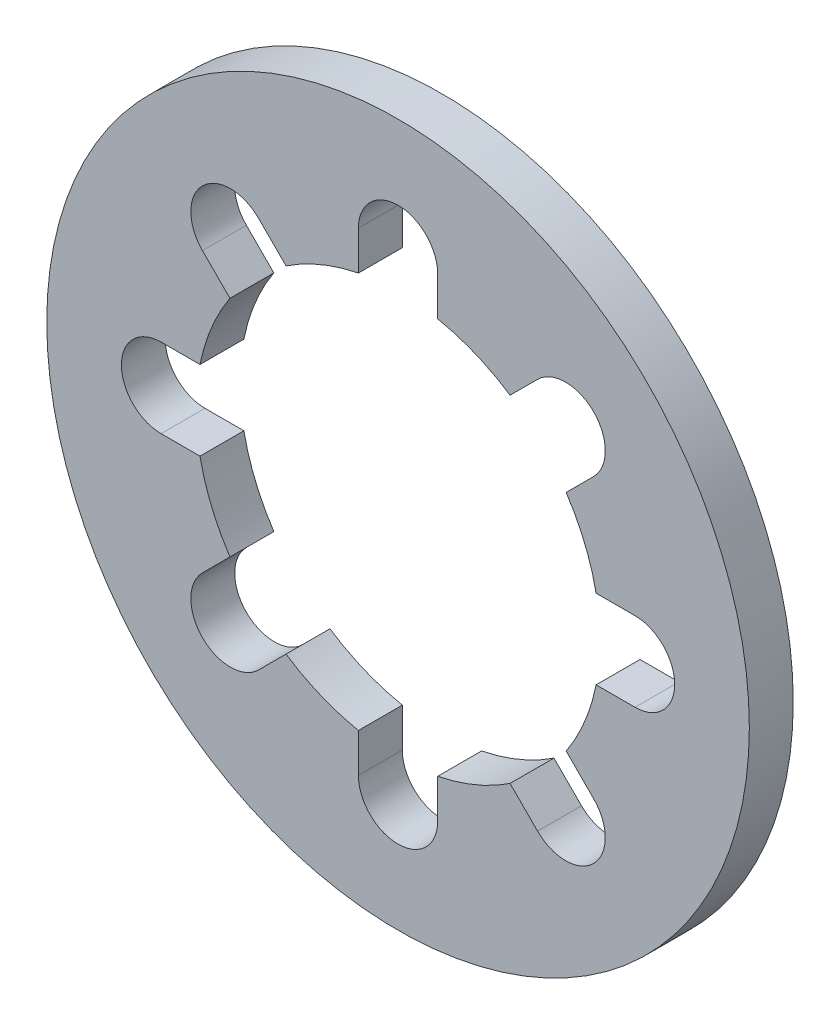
ISO-10303-21;
HEADER;
FILE_DESCRIPTION(('STEP AP214'),'2;1');
FILE_NAME('part.step','',(''),(''),'','','');
FILE_SCHEMA(('AUTOMOTIVE_DESIGN { 1 0 10303 214 1 1 1 1 }'));
ENDSEC;
DATA;
#1=APPLICATION_CONTEXT('core data for automotive mechanical design processes');
#2=APPLICATION_PROTOCOL_DEFINITION('international standard','automotive_design',2000,#1);
#3=PRODUCT_CONTEXT('',#1,'mechanical');
#4=PRODUCT('Part','Part','',(#3));
#5=PRODUCT_RELATED_PRODUCT_CATEGORY('part','',(#4));
#6=PRODUCT_DEFINITION_FORMATION('','',#4);
#7=PRODUCT_DEFINITION_CONTEXT('part definition',#1,'design');
#8=PRODUCT_DEFINITION('design','',#6,#7);
#9=PRODUCT_DEFINITION_SHAPE('','',#8);
#10=(LENGTH_UNIT() NAMED_UNIT(*) SI_UNIT(.MILLI.,.METRE.));
#11=(NAMED_UNIT(*) PLANE_ANGLE_UNIT() SI_UNIT($,.RADIAN.));
#12=(NAMED_UNIT(*) SI_UNIT($,.STERADIAN.) SOLID_ANGLE_UNIT());
#13=UNCERTAINTY_MEASURE_WITH_UNIT(LENGTH_MEASURE(1.E-05),#10,'distance_accuracy_value','');
#14=(GEOMETRIC_REPRESENTATION_CONTEXT(3) GLOBAL_UNCERTAINTY_ASSIGNED_CONTEXT((#13)) GLOBAL_UNIT_ASSIGNED_CONTEXT((#10,
#11,#12)) REPRESENTATION_CONTEXT('',''));
#15=CARTESIAN_POINT('',(0.,0.,0.));
#16=DIRECTION('',(0.,0.,1.));
#17=DIRECTION('',(1.,0.,0.));
#18=AXIS2_PLACEMENT_3D('',#15,#16,#17);
#19=CARTESIAN_POINT('',(0.,0.,-0.5));
#20=DIRECTION('',(0.,0.,1.));
#21=DIRECTION('',(1.,0.,0.));
#22=AXIS2_PLACEMENT_3D('',#19,#20,#21);
#23=CYLINDRICAL_SURFACE('',#22,2.3);
#24=CARTESIAN_POINT('',(0.,0.,-0.5));
#25=DIRECTION('',(0.,0.,1.));
#26=DIRECTION('',(1.,0.,0.));
#27=AXIS2_PLACEMENT_3D('',#24,#25,#26);
#28=CIRCLE('',#27,2.3);
#29=CARTESIAN_POINT('',(1.27535521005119,1.91401909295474,-0.5));
#30=VERTEX_POINT('',#29);
#31=CARTESIAN_POINT('',(0.4516035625,2.25522819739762,-0.5));
#32=VERTEX_POINT('',#31);
#33=EDGE_CURVE('E273',#30,#32,#28,.T.);
#34=ORIENTED_EDGE('',*,*,#33,.F.);
#35=DIRECTION('',(0.,0.,1.));
#36=VECTOR('',#35,1.);
#37=CARTESIAN_POINT('',(1.27535521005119,1.91401909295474,-0.5));
#38=LINE('',#37,#36);
#39=CARTESIAN_POINT('',(1.27535521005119,1.91401909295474,0.));
#40=VERTEX_POINT('',#39);
#41=EDGE_CURVE('E479',#30,#40,#38,.T.);
#42=ORIENTED_EDGE('',*,*,#41,.T.);
#43=CARTESIAN_POINT('',(0.,0.,0.));
#44=DIRECTION('',(0.,0.,1.));
#45=DIRECTION('',(1.,0.,0.));
#46=AXIS2_PLACEMENT_3D('',#43,#44,#45);
#47=CIRCLE('',#46,2.3);
#48=CARTESIAN_POINT('',(0.4516035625,2.25522819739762,0.));
#49=VERTEX_POINT('',#48);
#50=EDGE_CURVE('E289',#40,#49,#47,.T.);
#51=ORIENTED_EDGE('',*,*,#50,.T.);
#52=DIRECTION('',(0.,0.,1.));
#53=VECTOR('',#52,1.);
#54=CARTESIAN_POINT('',(0.4516035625,2.25522819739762,-0.5));
#55=LINE('',#54,#53);
#56=EDGE_CURVE('E284',#32,#49,#55,.T.);
#57=ORIENTED_EDGE('',*,*,#56,.F.);
#58=EDGE_LOOP('',(#34,#42,#51,#57));
#59=FACE_BOUND('',#58,.T.);
#60=ADVANCED_FACE('F39',(#59),#23,.F.);
#61=CARTESIAN_POINT('',(2.25522819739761,0.451603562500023,0.));
#62=VERTEX_POINT('',#61);
#63=CARTESIAN_POINT('',(1.91401909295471,1.27535521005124,0.));
#64=VERTEX_POINT('',#63);
#65=EDGE_CURVE('E264',#62,#64,#47,.T.);
#66=ORIENTED_EDGE('',*,*,#65,.T.);
#67=DIRECTION('',(0.,0.,1.));
#68=VECTOR('',#67,1.);
#69=CARTESIAN_POINT('',(1.91401909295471,1.27535521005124,-0.5));
#70=LINE('',#69,#68);
#71=CARTESIAN_POINT('',(1.91401909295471,1.27535521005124,-0.5));
#72=VERTEX_POINT('',#71);
#73=EDGE_CURVE('E53',#72,#64,#70,.T.);
#74=ORIENTED_EDGE('',*,*,#73,.F.);
#75=CARTESIAN_POINT('',(2.25522819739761,0.451603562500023,-0.5));
#76=VERTEX_POINT('',#75);
#77=EDGE_CURVE('E261',#76,#72,#28,.T.);
#78=ORIENTED_EDGE('',*,*,#77,.F.);
#79=DIRECTION('',(0.,0.,1.));
#80=VECTOR('',#79,1.);
#81=CARTESIAN_POINT('',(2.25522819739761,0.451603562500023,-0.5));
#82=LINE('',#81,#80);
#83=EDGE_CURVE('E456',#76,#62,#82,.T.);
#84=ORIENTED_EDGE('',*,*,#83,.T.);
#85=EDGE_LOOP('',(#66,#74,#78,#84));
#86=FACE_BOUND('',#85,.T.);
#87=ADVANCED_FACE('F263',(#86),#23,.F.);
#88=CARTESIAN_POINT('',(1.91401909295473,-1.2753552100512,0.));
#89=VERTEX_POINT('',#88);
#90=CARTESIAN_POINT('',(2.25522819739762,-0.451603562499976,0.));
#91=VERTEX_POINT('',#90);
#92=EDGE_CURVE('E305',#89,#91,#47,.T.);
#93=ORIENTED_EDGE('',*,*,#92,.T.);
#94=DIRECTION('',(0.,0.,1.));
#95=VECTOR('',#94,1.);
#96=CARTESIAN_POINT('',(2.25522819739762,-0.451603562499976,-0.5));
#97=LINE('',#96,#95);
#98=CARTESIAN_POINT('',(2.25522819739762,-0.451603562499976,-0.5));
#99=VERTEX_POINT('',#98);
#100=EDGE_CURVE('E65',#99,#91,#97,.T.);
#101=ORIENTED_EDGE('',*,*,#100,.F.);
#102=CARTESIAN_POINT('',(1.91401909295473,-1.2753552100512,-0.5));
#103=VERTEX_POINT('',#102);
#104=EDGE_CURVE('E274',#103,#99,#28,.T.);
#105=ORIENTED_EDGE('',*,*,#104,.F.);
#106=DIRECTION('',(0.,0.,1.));
#107=VECTOR('',#106,1.);
#108=CARTESIAN_POINT('',(1.91401909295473,-1.2753552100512,-0.5));
#109=LINE('',#108,#107);
#110=EDGE_CURVE('E435',#103,#89,#109,.T.);
#111=ORIENTED_EDGE('',*,*,#110,.T.);
#112=EDGE_LOOP('',(#93,#101,#105,#111));
#113=FACE_BOUND('',#112,.T.);
#114=ADVANCED_FACE('F529',(#113),#23,.F.);
#115=CARTESIAN_POINT('',(0.451603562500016,-2.25522819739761,0.));
#116=VERTEX_POINT('',#115);
#117=CARTESIAN_POINT('',(1.27535521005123,-1.91401909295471,0.));
#118=VERTEX_POINT('',#117);
#119=EDGE_CURVE('E852',#116,#118,#47,.T.);
#120=ORIENTED_EDGE('',*,*,#119,.T.);
#121=DIRECTION('',(0.,0.,1.));
#122=VECTOR('',#121,1.);
#123=CARTESIAN_POINT('',(1.27535521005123,-1.91401909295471,-0.5));
#124=LINE('',#123,#122);
#125=CARTESIAN_POINT('',(1.27535521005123,-1.91401909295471,-0.5));
#126=VERTEX_POINT('',#125);
#127=EDGE_CURVE('E439',#126,#118,#124,.T.);
#128=ORIENTED_EDGE('',*,*,#127,.F.);
#129=CARTESIAN_POINT('',(0.451603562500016,-2.25522819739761,-0.5));
#130=VERTEX_POINT('',#129);
#131=EDGE_CURVE('E277',#130,#126,#28,.T.);
#132=ORIENTED_EDGE('',*,*,#131,.F.);
#133=DIRECTION('',(0.,0.,1.));
#134=VECTOR('',#133,1.);
#135=CARTESIAN_POINT('',(0.451603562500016,-2.25522819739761,-0.5));
#136=LINE('',#135,#134);
#137=EDGE_CURVE('E406',#130,#116,#136,.T.);
#138=ORIENTED_EDGE('',*,*,#137,.T.);
#139=EDGE_LOOP('',(#120,#128,#132,#138));
#140=FACE_BOUND('',#139,.T.);
#141=ADVANCED_FACE('F763',(#140),#23,.F.);
#142=CARTESIAN_POINT('',(-1.27535521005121,-1.91401909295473,0.));
#143=VERTEX_POINT('',#142);
#144=CARTESIAN_POINT('',(-0.451603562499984,-2.25522819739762,0.));
#145=VERTEX_POINT('',#144);
#146=EDGE_CURVE('E864',#143,#145,#47,.T.);
#147=ORIENTED_EDGE('',*,*,#146,.T.);
#148=DIRECTION('',(0.,0.,1.));
#149=VECTOR('',#148,1.);
#150=CARTESIAN_POINT('',(-0.451603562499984,-2.25522819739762,-0.5));
#151=LINE('',#150,#149);
#152=CARTESIAN_POINT('',(-0.451603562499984,-2.25522819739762,-0.5));
#153=VERTEX_POINT('',#152);
#154=EDGE_CURVE('E412',#153,#145,#151,.T.);
#155=ORIENTED_EDGE('',*,*,#154,.F.);
#156=CARTESIAN_POINT('',(-1.27535521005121,-1.91401909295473,-0.5));
#157=VERTEX_POINT('',#156);
#158=EDGE_CURVE('E844',#157,#153,#28,.T.);
#159=ORIENTED_EDGE('',*,*,#158,.F.);
#160=DIRECTION('',(0.,0.,1.));
#161=VECTOR('',#160,1.);
#162=CARTESIAN_POINT('',(-1.27535521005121,-1.91401909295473,-0.5));
#163=LINE('',#162,#161);
#164=EDGE_CURVE('E379',#157,#143,#163,.T.);
#165=ORIENTED_EDGE('',*,*,#164,.T.);
#166=EDGE_LOOP('',(#147,#155,#159,#165));
#167=FACE_BOUND('',#166,.T.);
#168=ADVANCED_FACE('F775',(#167),#23,.F.);
#169=CARTESIAN_POINT('',(-2.25522819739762,-0.451603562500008,0.));
#170=VERTEX_POINT('',#169);
#171=CARTESIAN_POINT('',(-1.91401909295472,-1.27535521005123,0.));
#172=VERTEX_POINT('',#171);
#173=EDGE_CURVE('E294',#170,#172,#47,.T.);
#174=ORIENTED_EDGE('',*,*,#173,.T.);
#175=DIRECTION('',(0.,0.,1.));
#176=VECTOR('',#175,1.);
#177=CARTESIAN_POINT('',(-1.91401909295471,-1.27535521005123,-0.5));
#178=LINE('',#177,#176);
#179=CARTESIAN_POINT('',(-1.91401909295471,-1.27535521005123,-0.5));
#180=VERTEX_POINT('',#179);
#181=EDGE_CURVE('E387',#180,#172,#178,.T.);
#182=ORIENTED_EDGE('',*,*,#181,.F.);
#183=CARTESIAN_POINT('',(-2.25522819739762,-0.451603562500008,-0.5));
#184=VERTEX_POINT('',#183);
#185=EDGE_CURVE('E842',#184,#180,#28,.T.);
#186=ORIENTED_EDGE('',*,*,#185,.F.);
#187=DIRECTION('',(0.,0.,1.));
#188=VECTOR('',#187,1.);
#189=CARTESIAN_POINT('',(-2.25522819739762,-0.451603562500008,-0.5));
#190=LINE('',#189,#188);
#191=EDGE_CURVE('E354',#184,#170,#190,.T.);
#192=ORIENTED_EDGE('',*,*,#191,.T.);
#193=EDGE_LOOP('',(#174,#182,#186,#192));
#194=FACE_BOUND('',#193,.T.);
#195=ADVANCED_FACE('F779',(#194),#23,.F.);
#196=CARTESIAN_POINT('',(-1.91401909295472,1.27535521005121,0.));
#197=VERTEX_POINT('',#196);
#198=CARTESIAN_POINT('',(-2.25522819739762,0.451603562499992,0.));
#199=VERTEX_POINT('',#198);
#200=EDGE_CURVE('E286',#197,#199,#47,.T.);
#201=ORIENTED_EDGE('',*,*,#200,.T.);
#202=DIRECTION('',(0.,0.,1.));
#203=VECTOR('',#202,1.);
#204=CARTESIAN_POINT('',(-2.25522819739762,0.451603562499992,-0.5));
#205=LINE('',#204,#203);
#206=CARTESIAN_POINT('',(-2.25522819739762,0.451603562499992,-0.5));
#207=VERTEX_POINT('',#206);
#208=EDGE_CURVE('E365',#207,#199,#205,.T.);
#209=ORIENTED_EDGE('',*,*,#208,.F.);
#210=CARTESIAN_POINT('',(-1.91401909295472,1.27535521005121,-0.5));
#211=VERTEX_POINT('',#210);
#212=EDGE_CURVE('E282',#211,#207,#28,.T.);
#213=ORIENTED_EDGE('',*,*,#212,.F.);
#214=DIRECTION('',(0.,0.,1.));
#215=VECTOR('',#214,1.);
#216=CARTESIAN_POINT('',(-1.91401909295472,1.27535521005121,-0.5));
#217=LINE('',#216,#215);
#218=EDGE_CURVE('E329',#211,#197,#217,.T.);
#219=ORIENTED_EDGE('',*,*,#218,.T.);
#220=EDGE_LOOP('',(#201,#209,#213,#219));
#221=FACE_BOUND('',#220,.T.);
#222=ADVANCED_FACE('F525',(#221),#23,.F.);
#223=CARTESIAN_POINT('',(0.,0.,-0.5));
#224=DIRECTION('',(0.,0.,1.));
#225=DIRECTION('',(1.,0.,0.));
#226=AXIS2_PLACEMENT_3D('',#223,#224,#225);
#227=CYLINDRICAL_SURFACE('',#226,4.);
#228=CARTESIAN_POINT('',(0.,0.,-0.5));
#229=DIRECTION('',(0.,0.,1.));
#230=DIRECTION('',(1.,0.,0.));
#231=AXIS2_PLACEMENT_3D('',#228,#229,#230);
#232=CIRCLE('',#231,4.);
#233=CARTESIAN_POINT('',(4.,0.,-0.5));
#234=VERTEX_POINT('',#233);
#235=EDGE_CURVE('E11',#234,#234,#232,.T.);
#236=ORIENTED_EDGE('',*,*,#235,.T.);
#237=EDGE_LOOP('',(#236));
#238=FACE_BOUND('',#237,.T.);
#239=CARTESIAN_POINT('',(0.,0.,0.));
#240=DIRECTION('',(0.,0.,1.));
#241=DIRECTION('',(1.,0.,0.));
#242=AXIS2_PLACEMENT_3D('',#239,#240,#241);
#243=CIRCLE('',#242,4.);
#244=CARTESIAN_POINT('',(4.,0.,0.));
#245=VERTEX_POINT('',#244);
#246=EDGE_CURVE('E43',#245,#245,#243,.T.);
#247=ORIENTED_EDGE('',*,*,#246,.F.);
#248=EDGE_LOOP('',(#247));
#249=FACE_BOUND('',#248,.T.);
#250=ADVANCED_FACE('F41',(#238,#249),#227,.T.);
#251=CARTESIAN_POINT('',(0.,0.,-0.5));
#252=DIRECTION('',(0.,0.,1.));
#253=DIRECTION('',(1.,0.,0.));
#254=AXIS2_PLACEMENT_3D('',#251,#252,#253);
#255=PLANE('',#254);
#256=CARTESIAN_POINT('',(1.90805441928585,1.9080544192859,-0.5));
#257=DIRECTION('',(0.,0.,1.));
#258=DIRECTION('',(-0.707106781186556,0.707106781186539,0.));
#259=AXIS2_PLACEMENT_3D('',#256,#257,#258);
#260=CIRCLE('',#259,0.4516035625);
#261=CARTESIAN_POINT('',(2.22738636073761,1.58872247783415,-0.5));
#262=VERTEX_POINT('',#261);
#263=CARTESIAN_POINT('',(1.58872247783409,2.22738636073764,-0.5));
#264=VERTEX_POINT('',#263);
#265=EDGE_CURVE('E253',#262,#264,#260,.T.);
#266=ORIENTED_EDGE('',*,*,#265,.T.);
#267=DIRECTION('',(-0.707106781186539,-0.707106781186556,0.));
#268=VECTOR('',#267,1.);
#269=CARTESIAN_POINT('',(1.27535521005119,1.91401909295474,-0.5));
#270=LINE('',#269,#268);
#271=EDGE_CURVE('E268',#264,#30,#270,.T.);
#272=ORIENTED_EDGE('',*,*,#271,.T.);
#273=ORIENTED_EDGE('',*,*,#33,.T.);
#274=DIRECTION('',(0.,1.,0.));
#275=VECTOR('',#274,1.);
#276=CARTESIAN_POINT('',(0.4516035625,2.6983964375,-0.5));
#277=LINE('',#276,#275);
#278=CARTESIAN_POINT('',(0.4516035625,2.6983964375,-0.5));
#279=VERTEX_POINT('',#278);
#280=EDGE_CURVE('E323',#32,#279,#277,.T.);
#281=ORIENTED_EDGE('',*,*,#280,.T.);
#282=CARTESIAN_POINT('',(0.,2.6983964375,-0.5));
#283=DIRECTION('',(0.,0.,1.));
#284=DIRECTION('',(-1.,0.,0.));
#285=AXIS2_PLACEMENT_3D('',#282,#283,#284);
#286=CIRCLE('',#285,0.4516035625);
#287=CARTESIAN_POINT('',(-0.4516035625,2.6983964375,-0.5));
#288=VERTEX_POINT('',#287);
#289=EDGE_CURVE('E318',#279,#288,#286,.T.);
#290=ORIENTED_EDGE('',*,*,#289,.T.);
#291=DIRECTION('',(0.,-1.,0.));
#292=VECTOR('',#291,1.);
#293=CARTESIAN_POINT('',(-0.4516035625,2.25522819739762,-0.5));
#294=LINE('',#293,#292);
#295=CARTESIAN_POINT('',(-0.4516035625,2.25522819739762,-0.5));
#296=VERTEX_POINT('',#295);
#297=EDGE_CURVE('E314',#288,#296,#294,.T.);
#298=ORIENTED_EDGE('',*,*,#297,.T.);
#299=CARTESIAN_POINT('',(-1.27535521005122,1.91401909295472,-0.5));
#300=VERTEX_POINT('',#299);
#301=EDGE_CURVE('E279',#296,#300,#28,.T.);
#302=ORIENTED_EDGE('',*,*,#301,.T.);
#303=DIRECTION('',(-0.707106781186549,0.707106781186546,0.));
#304=VECTOR('',#303,1.);
#305=CARTESIAN_POINT('',(-1.58872247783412,2.22738636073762,-0.5));
#306=LINE('',#305,#304);
#307=CARTESIAN_POINT('',(-1.58872247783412,2.22738636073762,-0.5));
#308=VERTEX_POINT('',#307);
#309=EDGE_CURVE('E350',#300,#308,#306,.T.);
#310=ORIENTED_EDGE('',*,*,#309,.T.);
#311=CARTESIAN_POINT('',(-1.90805441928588,1.90805441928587,-0.5));
#312=DIRECTION('',(0.,0.,1.));
#313=DIRECTION('',(-0.707106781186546,-0.707106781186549,0.));
#314=AXIS2_PLACEMENT_3D('',#311,#312,#313);
#315=CIRCLE('',#314,0.4516035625);
#316=CARTESIAN_POINT('',(-2.22738636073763,1.58872247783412,-0.5));
#317=VERTEX_POINT('',#316);
#318=EDGE_CURVE('E357',#308,#317,#315,.T.);
#319=ORIENTED_EDGE('',*,*,#318,.T.);
#320=DIRECTION('',(0.707106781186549,-0.707106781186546,0.));
#321=VECTOR('',#320,1.);
#322=CARTESIAN_POINT('',(-1.91401909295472,1.27535521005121,-0.5));
#323=LINE('',#322,#321);
#324=EDGE_CURVE('E339',#317,#211,#323,.T.);
#325=ORIENTED_EDGE('',*,*,#324,.T.);
#326=ORIENTED_EDGE('',*,*,#212,.T.);
#327=DIRECTION('',(-1.,0.,0.));
#328=VECTOR('',#327,1.);
#329=CARTESIAN_POINT('',(-2.6983964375,0.45160356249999,-0.5));
#330=LINE('',#329,#328);
#331=CARTESIAN_POINT('',(-2.6983964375,0.45160356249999,-0.5));
#332=VERTEX_POINT('',#331);
#333=EDGE_CURVE('E373',#207,#332,#330,.T.);
#334=ORIENTED_EDGE('',*,*,#333,.T.);
#335=CARTESIAN_POINT('',(-2.6983964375,0.,-0.5));
#336=DIRECTION('',(0.,0.,1.));
#337=DIRECTION('',(0.,-1.,0.));
#338=AXIS2_PLACEMENT_3D('',#335,#336,#337);
#339=CIRCLE('',#338,0.4516035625);
#340=CARTESIAN_POINT('',(-2.6983964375,-0.451603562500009,-0.5));
#341=VERTEX_POINT('',#340);
#342=EDGE_CURVE('E384',#332,#341,#339,.T.);
#343=ORIENTED_EDGE('',*,*,#342,.T.);
#344=DIRECTION('',(1.,0.,0.));
#345=VECTOR('',#344,1.);
#346=CARTESIAN_POINT('',(-2.25522819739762,-0.451603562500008,-0.5));
#347=LINE('',#346,#345);
#348=EDGE_CURVE('E362',#341,#184,#347,.T.);
#349=ORIENTED_EDGE('',*,*,#348,.T.);
#350=ORIENTED_EDGE('',*,*,#185,.T.);
#351=DIRECTION('',(-0.707106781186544,-0.707106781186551,0.));
#352=VECTOR('',#351,1.);
#353=CARTESIAN_POINT('',(-2.22738636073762,-1.58872247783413,-0.5));
#354=LINE('',#353,#352);
#355=CARTESIAN_POINT('',(-2.22738636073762,-1.58872247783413,-0.5));
#356=VERTEX_POINT('',#355);
#357=EDGE_CURVE('E399',#180,#356,#354,.T.);
#358=ORIENTED_EDGE('',*,*,#357,.T.);
#359=CARTESIAN_POINT('',(-1.90805441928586,-1.90805441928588,-0.5));
#360=DIRECTION('',(0.,0.,1.));
#361=DIRECTION('',(0.707106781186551,-0.707106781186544,0.));
#362=AXIS2_PLACEMENT_3D('',#359,#360,#361);
#363=CIRCLE('',#362,0.4516035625);
#364=CARTESIAN_POINT('',(-1.58872247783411,-2.22738636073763,-0.5));
#365=VERTEX_POINT('',#364);
#366=EDGE_CURVE('E408',#356,#365,#363,.T.);
#367=ORIENTED_EDGE('',*,*,#366,.T.);
#368=DIRECTION('',(0.707106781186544,0.707106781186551,0.));
#369=VECTOR('',#368,1.);
#370=CARTESIAN_POINT('',(-1.27535521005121,-1.91401909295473,-0.5));
#371=LINE('',#370,#369);
#372=EDGE_CURVE('E393',#365,#157,#371,.T.);
#373=ORIENTED_EDGE('',*,*,#372,.T.);
#374=ORIENTED_EDGE('',*,*,#158,.T.);
#375=DIRECTION('',(0.,-1.,0.));
#376=VECTOR('',#375,1.);
#377=CARTESIAN_POINT('',(-0.451603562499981,-2.6983964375,-0.5));
#378=LINE('',#377,#376);
#379=CARTESIAN_POINT('',(-0.451603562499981,-2.6983964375,-0.5));
#380=VERTEX_POINT('',#379);
#381=EDGE_CURVE('E424',#153,#380,#378,.T.);
#382=ORIENTED_EDGE('',*,*,#381,.T.);
#383=CARTESIAN_POINT('',(0.,-2.6983964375,-0.5));
#384=DIRECTION('',(0.,0.,1.));
#385=DIRECTION('',(1.,0.,0.));
#386=AXIS2_PLACEMENT_3D('',#383,#384,#385);
#387=CIRCLE('',#386,0.4516035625);
#388=CARTESIAN_POINT('',(0.451603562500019,-2.6983964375,-0.5));
#389=VERTEX_POINT('',#388);
#390=EDGE_CURVE('E434',#380,#389,#387,.T.);
#391=ORIENTED_EDGE('',*,*,#390,.T.);
#392=DIRECTION('',(0.,1.,0.));
#393=VECTOR('',#392,1.);
#394=CARTESIAN_POINT('',(0.451603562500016,-2.25522819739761,-0.5));
#395=LINE('',#394,#393);
#396=EDGE_CURVE('E420',#389,#130,#395,.T.);
#397=ORIENTED_EDGE('',*,*,#396,.T.);
#398=ORIENTED_EDGE('',*,*,#131,.T.);
#399=DIRECTION('',(0.707106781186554,-0.707106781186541,0.));
#400=VECTOR('',#399,1.);
#401=CARTESIAN_POINT('',(1.58872247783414,-2.22738636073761,-0.5));
#402=LINE('',#401,#400);
#403=CARTESIAN_POINT('',(1.58872247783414,-2.22738636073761,-0.5));
#404=VERTEX_POINT('',#403);
#405=EDGE_CURVE('E451',#126,#404,#402,.T.);
#406=ORIENTED_EDGE('',*,*,#405,.T.);
#407=CARTESIAN_POINT('',(1.90805441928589,-1.90805441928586,-0.5));
#408=DIRECTION('',(0.,0.,1.));
#409=DIRECTION('',(0.707106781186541,0.707106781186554,0.));
#410=AXIS2_PLACEMENT_3D('',#407,#408,#409);
#411=CIRCLE('',#410,0.4516035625);
#412=CARTESIAN_POINT('',(2.22738636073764,-1.5887224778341,-0.5));
#413=VERTEX_POINT('',#412);
#414=EDGE_CURVE('E463',#404,#413,#411,.T.);
#415=ORIENTED_EDGE('',*,*,#414,.T.);
#416=DIRECTION('',(-0.707106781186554,0.707106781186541,0.));
#417=VECTOR('',#416,1.);
#418=CARTESIAN_POINT('',(1.91401909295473,-1.2753552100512,-0.5));
#419=LINE('',#418,#417);
#420=EDGE_CURVE('E442',#413,#103,#419,.T.);
#421=ORIENTED_EDGE('',*,*,#420,.T.);
#422=ORIENTED_EDGE('',*,*,#104,.T.);
#423=DIRECTION('',(1.,0.,0.));
#424=VECTOR('',#423,1.);
#425=CARTESIAN_POINT('',(2.6983964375,-0.451603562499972,-0.5));
#426=LINE('',#425,#424);
#427=CARTESIAN_POINT('',(2.6983964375,-0.451603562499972,-0.5));
#428=VERTEX_POINT('',#427);
#429=EDGE_CURVE('E473',#99,#428,#426,.T.);
#430=ORIENTED_EDGE('',*,*,#429,.T.);
#431=CARTESIAN_POINT('',(2.6983964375,0.,-0.5));
#432=DIRECTION('',(0.,0.,1.));
#433=DIRECTION('',(0.,1.,0.));
#434=AXIS2_PLACEMENT_3D('',#431,#432,#433);
#435=CIRCLE('',#434,0.4516035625);
#436=CARTESIAN_POINT('',(2.6983964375,0.451603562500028,-0.5));
#437=VERTEX_POINT('',#436);
#438=EDGE_CURVE('E485',#428,#437,#435,.T.);
#439=ORIENTED_EDGE('',*,*,#438,.T.);
#440=DIRECTION('',(-1.,0.,0.));
#441=VECTOR('',#440,1.);
#442=CARTESIAN_POINT('',(2.25522819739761,0.451603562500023,-0.5));
#443=LINE('',#442,#441);
#444=EDGE_CURVE('E271',#437,#76,#443,.T.);
#445=ORIENTED_EDGE('',*,*,#444,.T.);
#446=ORIENTED_EDGE('',*,*,#77,.T.);
#447=DIRECTION('',(0.707106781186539,0.707106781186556,0.));
#448=VECTOR('',#447,1.);
#449=CARTESIAN_POINT('',(2.22738636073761,1.58872247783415,-0.5));
#450=LINE('',#449,#448);
#451=EDGE_CURVE('E247',#72,#262,#450,.T.);
#452=ORIENTED_EDGE('',*,*,#451,.T.);
#453=EDGE_LOOP('',(#266,#272,#273,#281,#290,#298,#302,#310,#319,#325,#326,#334,#343,#349,#350,
#358,#367,#373,#374,#382,#391,#397,#398,#406,#415,#421,#422,#430,#439,#445,#446,#452));
#454=FACE_BOUND('',#453,.T.);
#455=ORIENTED_EDGE('',*,*,#235,.F.);
#456=EDGE_LOOP('',(#455));
#457=FACE_BOUND('',#456,.T.);
#458=ADVANCED_FACE('F269',(#454,#457),#255,.F.);
#459=CARTESIAN_POINT('',(0.,0.,0.));
#460=DIRECTION('',(0.,0.,1.));
#461=DIRECTION('',(1.,0.,0.));
#462=AXIS2_PLACEMENT_3D('',#459,#460,#461);
#463=PLANE('',#462);
#464=DIRECTION('',(-0.707106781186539,-0.707106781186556,0.));
#465=VECTOR('',#464,1.);
#466=CARTESIAN_POINT('',(1.27535521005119,1.91401909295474,0.));
#467=LINE('',#466,#465);
#468=CARTESIAN_POINT('',(1.58872247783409,2.22738636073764,0.));
#469=VERTEX_POINT('',#468);
#470=EDGE_CURVE('E256',#469,#40,#467,.T.);
#471=ORIENTED_EDGE('',*,*,#470,.F.);
#472=CARTESIAN_POINT('',(1.90805441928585,1.9080544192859,0.));
#473=DIRECTION('',(0.,0.,1.));
#474=DIRECTION('',(-0.707106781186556,0.707106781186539,0.));
#475=AXIS2_PLACEMENT_3D('',#472,#473,#474);
#476=CIRCLE('',#475,0.4516035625);
#477=CARTESIAN_POINT('',(2.22738636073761,1.58872247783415,0.));
#478=VERTEX_POINT('',#477);
#479=EDGE_CURVE('E493',#478,#469,#476,.T.);
#480=ORIENTED_EDGE('',*,*,#479,.F.);
#481=DIRECTION('',(0.707106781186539,0.707106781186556,0.));
#482=VECTOR('',#481,1.);
#483=CARTESIAN_POINT('',(2.22738636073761,1.58872247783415,0.));
#484=LINE('',#483,#482);
#485=EDGE_CURVE('E494',#64,#478,#484,.T.);
#486=ORIENTED_EDGE('',*,*,#485,.F.);
#487=ORIENTED_EDGE('',*,*,#65,.F.);
#488=DIRECTION('',(-1.,0.,0.));
#489=VECTOR('',#488,1.);
#490=CARTESIAN_POINT('',(2.25522819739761,0.451603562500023,0.));
#491=LINE('',#490,#489);
#492=CARTESIAN_POINT('',(2.6983964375,0.451603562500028,0.));
#493=VERTEX_POINT('',#492);
#494=EDGE_CURVE('E475',#493,#62,#491,.T.);
#495=ORIENTED_EDGE('',*,*,#494,.F.);
#496=CARTESIAN_POINT('',(2.6983964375,0.,0.));
#497=DIRECTION('',(0.,0.,1.));
#498=DIRECTION('',(0.,1.,0.));
#499=AXIS2_PLACEMENT_3D('',#496,#497,#498);
#500=CIRCLE('',#499,0.4516035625);
#501=CARTESIAN_POINT('',(2.6983964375,-0.451603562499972,0.));
#502=VERTEX_POINT('',#501);
#503=EDGE_CURVE('E474',#502,#493,#500,.T.);
#504=ORIENTED_EDGE('',*,*,#503,.F.);
#505=DIRECTION('',(1.,0.,0.));
#506=VECTOR('',#505,1.);
#507=CARTESIAN_POINT('',(2.6983964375,-0.451603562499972,0.));
#508=LINE('',#507,#506);
#509=EDGE_CURVE('E476',#91,#502,#508,.T.);
#510=ORIENTED_EDGE('',*,*,#509,.F.);
#511=ORIENTED_EDGE('',*,*,#92,.F.);
#512=DIRECTION('',(-0.707106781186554,0.707106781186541,0.));
#513=VECTOR('',#512,1.);
#514=CARTESIAN_POINT('',(1.91401909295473,-1.2753552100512,0.));
#515=LINE('',#514,#513);
#516=CARTESIAN_POINT('',(2.22738636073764,-1.5887224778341,0.));
#517=VERTEX_POINT('',#516);
#518=EDGE_CURVE('E446',#517,#89,#515,.T.);
#519=ORIENTED_EDGE('',*,*,#518,.F.);
#520=CARTESIAN_POINT('',(1.90805441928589,-1.90805441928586,0.));
#521=DIRECTION('',(0.,0.,1.));
#522=DIRECTION('',(0.707106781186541,0.707106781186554,0.));
#523=AXIS2_PLACEMENT_3D('',#520,#521,#522);
#524=CIRCLE('',#523,0.4516035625);
#525=CARTESIAN_POINT('',(1.58872247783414,-2.22738636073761,0.));
#526=VERTEX_POINT('',#525);
#527=EDGE_CURVE('E455',#526,#517,#524,.T.);
#528=ORIENTED_EDGE('',*,*,#527,.F.);
#529=DIRECTION('',(0.707106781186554,-0.707106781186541,0.));
#530=VECTOR('',#529,1.);
#531=CARTESIAN_POINT('',(1.58872247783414,-2.22738636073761,0.));
#532=LINE('',#531,#530);
#533=EDGE_CURVE('E454',#118,#526,#532,.T.);
#534=ORIENTED_EDGE('',*,*,#533,.F.);
#535=ORIENTED_EDGE('',*,*,#119,.F.);
#536=DIRECTION('',(0.,1.,0.));
#537=VECTOR('',#536,1.);
#538=CARTESIAN_POINT('',(0.451603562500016,-2.25522819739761,0.));
#539=LINE('',#538,#537);
#540=CARTESIAN_POINT('',(0.451603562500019,-2.6983964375,0.));
#541=VERTEX_POINT('',#540);
#542=EDGE_CURVE('E421',#541,#116,#539,.T.);
#543=ORIENTED_EDGE('',*,*,#542,.F.);
#544=CARTESIAN_POINT('',(0.,-2.6983964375,0.));
#545=DIRECTION('',(0.,0.,1.));
#546=DIRECTION('',(1.,0.,0.));
#547=AXIS2_PLACEMENT_3D('',#544,#545,#546);
#548=CIRCLE('',#547,0.4516035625);
#549=CARTESIAN_POINT('',(-0.451603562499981,-2.6983964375,0.));
#550=VERTEX_POINT('',#549);
#551=EDGE_CURVE('E428',#550,#541,#548,.T.);
#552=ORIENTED_EDGE('',*,*,#551,.F.);
#553=DIRECTION('',(0.,-1.,0.));
#554=VECTOR('',#553,1.);
#555=CARTESIAN_POINT('',(-0.451603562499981,-2.6983964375,0.));
#556=LINE('',#555,#554);
#557=EDGE_CURVE('E429',#145,#550,#556,.T.);
#558=ORIENTED_EDGE('',*,*,#557,.F.);
#559=ORIENTED_EDGE('',*,*,#146,.F.);
#560=DIRECTION('',(0.707106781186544,0.707106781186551,0.));
#561=VECTOR('',#560,1.);
#562=CARTESIAN_POINT('',(-1.27535521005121,-1.91401909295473,0.));
#563=LINE('',#562,#561);
#564=CARTESIAN_POINT('',(-1.58872247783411,-2.22738636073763,0.));
#565=VERTEX_POINT('',#564);
#566=EDGE_CURVE('E400',#565,#143,#563,.T.);
#567=ORIENTED_EDGE('',*,*,#566,.F.);
#568=CARTESIAN_POINT('',(-1.90805441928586,-1.90805441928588,0.));
#569=DIRECTION('',(0.,0.,1.));
#570=DIRECTION('',(0.707106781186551,-0.707106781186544,0.));
#571=AXIS2_PLACEMENT_3D('',#568,#569,#570);
#572=CIRCLE('',#571,0.4516035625);
#573=CARTESIAN_POINT('',(-2.22738636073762,-1.58872247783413,0.));
#574=VERTEX_POINT('',#573);
#575=EDGE_CURVE('E397',#574,#565,#572,.T.);
#576=ORIENTED_EDGE('',*,*,#575,.F.);
#577=DIRECTION('',(-0.707106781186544,-0.707106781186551,0.));
#578=VECTOR('',#577,1.);
#579=CARTESIAN_POINT('',(-2.22738636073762,-1.58872247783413,0.));
#580=LINE('',#579,#578);
#581=EDGE_CURVE('E401',#172,#574,#580,.T.);
#582=ORIENTED_EDGE('',*,*,#581,.F.);
#583=ORIENTED_EDGE('',*,*,#173,.F.);
#584=DIRECTION('',(1.,0.,0.));
#585=VECTOR('',#584,1.);
#586=CARTESIAN_POINT('',(-2.25522819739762,-0.451603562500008,0.));
#587=LINE('',#586,#585);
#588=CARTESIAN_POINT('',(-2.6983964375,-0.451603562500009,0.));
#589=VERTEX_POINT('',#588);
#590=EDGE_CURVE('E371',#589,#170,#587,.T.);
#591=ORIENTED_EDGE('',*,*,#590,.F.);
#592=CARTESIAN_POINT('',(-2.6983964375,0.,0.));
#593=DIRECTION('',(0.,0.,1.));
#594=DIRECTION('',(0.,-1.,0.));
#595=AXIS2_PLACEMENT_3D('',#592,#593,#594);
#596=CIRCLE('',#595,0.4516035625);
#597=CARTESIAN_POINT('',(-2.6983964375,0.45160356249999,0.));
#598=VERTEX_POINT('',#597);
#599=EDGE_CURVE('E372',#598,#589,#596,.T.);
#600=ORIENTED_EDGE('',*,*,#599,.F.);
#601=DIRECTION('',(-1.,0.,0.));
#602=VECTOR('',#601,1.);
#603=CARTESIAN_POINT('',(-2.6983964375,0.45160356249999,0.));
#604=LINE('',#603,#602);
#605=EDGE_CURVE('E380',#199,#598,#604,.T.);
#606=ORIENTED_EDGE('',*,*,#605,.F.);
#607=ORIENTED_EDGE('',*,*,#200,.F.);
#608=DIRECTION('',(0.707106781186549,-0.707106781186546,0.));
#609=VECTOR('',#608,1.);
#610=CARTESIAN_POINT('',(-1.91401909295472,1.27535521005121,0.));
#611=LINE('',#610,#609);
#612=CARTESIAN_POINT('',(-2.22738636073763,1.58872247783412,0.));
#613=VERTEX_POINT('',#612);
#614=EDGE_CURVE('E344',#613,#197,#611,.T.);
#615=ORIENTED_EDGE('',*,*,#614,.F.);
#616=CARTESIAN_POINT('',(-1.90805441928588,1.90805441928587,0.));
#617=DIRECTION('',(0.,0.,1.));
#618=DIRECTION('',(-0.707106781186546,-0.707106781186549,0.));
#619=AXIS2_PLACEMENT_3D('',#616,#617,#618);
#620=CIRCLE('',#619,0.4516035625);
#621=CARTESIAN_POINT('',(-1.58872247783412,2.22738636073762,0.));
#622=VERTEX_POINT('',#621);
#623=EDGE_CURVE('E346',#622,#613,#620,.T.);
#624=ORIENTED_EDGE('',*,*,#623,.F.);
#625=DIRECTION('',(-0.707106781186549,0.707106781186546,0.));
#626=VECTOR('',#625,1.);
#627=CARTESIAN_POINT('',(-1.58872247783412,2.22738636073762,0.));
#628=LINE('',#627,#626);
#629=CARTESIAN_POINT('',(-1.27535521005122,1.91401909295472,0.));
#630=VERTEX_POINT('',#629);
#631=EDGE_CURVE('E353',#630,#622,#628,.T.);
#632=ORIENTED_EDGE('',*,*,#631,.F.);
#633=CARTESIAN_POINT('',(-0.4516035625,2.25522819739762,0.));
#634=VERTEX_POINT('',#633);
#635=EDGE_CURVE('E278',#634,#630,#47,.T.);
#636=ORIENTED_EDGE('',*,*,#635,.F.);
#637=DIRECTION('',(0.,-1.,0.));
#638=VECTOR('',#637,1.);
#639=CARTESIAN_POINT('',(-0.4516035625,2.25522819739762,0.));
#640=LINE('',#639,#638);
#641=CARTESIAN_POINT('',(-0.4516035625,2.6983964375,0.));
#642=VERTEX_POINT('',#641);
#643=EDGE_CURVE('E307',#642,#634,#640,.T.);
#644=ORIENTED_EDGE('',*,*,#643,.F.);
#645=CARTESIAN_POINT('',(0.,2.6983964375,0.));
#646=DIRECTION('',(0.,0.,1.));
#647=DIRECTION('',(-1.,0.,0.));
#648=AXIS2_PLACEMENT_3D('',#645,#646,#647);
#649=CIRCLE('',#648,0.4516035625);
#650=CARTESIAN_POINT('',(0.4516035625,2.6983964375,0.));
#651=VERTEX_POINT('',#650);
#652=EDGE_CURVE('E327',#651,#642,#649,.T.);
#653=ORIENTED_EDGE('',*,*,#652,.F.);
#654=DIRECTION('',(0.,1.,0.));
#655=VECTOR('',#654,1.);
#656=CARTESIAN_POINT('',(0.4516035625,2.6983964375,0.));
#657=LINE('',#656,#655);
#658=EDGE_CURVE('E326',#49,#651,#657,.T.);
#659=ORIENTED_EDGE('',*,*,#658,.F.);
#660=ORIENTED_EDGE('',*,*,#50,.F.);
#661=EDGE_LOOP('',(#471,#480,#486,#487,#495,#504,#510,#511,#519,#528,#534,#535,#543,#552,#558,
#559,#567,#576,#582,#583,#591,#600,#606,#607,#615,#624,#632,#636,#644,#653,#659,#660));
#662=FACE_BOUND('',#661,.T.);
#663=ORIENTED_EDGE('',*,*,#246,.T.);
#664=EDGE_LOOP('',(#663));
#665=FACE_BOUND('',#664,.T.);
#666=ADVANCED_FACE('F510',(#662,#665),#463,.T.);
#667=ORIENTED_EDGE('',*,*,#635,.T.);
#668=DIRECTION('',(0.,0.,1.));
#669=VECTOR('',#668,1.);
#670=CARTESIAN_POINT('',(-1.27535521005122,1.91401909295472,-0.5));
#671=LINE('',#670,#669);
#672=EDGE_CURVE('E337',#300,#630,#671,.T.);
#673=ORIENTED_EDGE('',*,*,#672,.F.);
#674=ORIENTED_EDGE('',*,*,#301,.F.);
#675=DIRECTION('',(0.,0.,1.));
#676=VECTOR('',#675,1.);
#677=CARTESIAN_POINT('',(-0.4516035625,2.25522819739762,-0.5));
#678=LINE('',#677,#676);
#679=EDGE_CURVE('E298',#296,#634,#678,.T.);
#680=ORIENTED_EDGE('',*,*,#679,.T.);
#681=EDGE_LOOP('',(#667,#673,#674,#680));
#682=FACE_BOUND('',#681,.T.);
#683=ADVANCED_FACE('F514',(#682),#23,.F.);
#684=CARTESIAN_POINT('',(-0.4516035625,2.25522819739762,-0.5));
#685=DIRECTION('',(-1.,0.,0.));
#686=DIRECTION('',(0.,0.,1.));
#687=AXIS2_PLACEMENT_3D('',#684,#685,#686);
#688=PLANE('',#687);
#689=ORIENTED_EDGE('',*,*,#643,.T.);
#690=ORIENTED_EDGE('',*,*,#679,.F.);
#691=ORIENTED_EDGE('',*,*,#297,.F.);
#692=DIRECTION('',(0.,0.,1.));
#693=VECTOR('',#692,1.);
#694=CARTESIAN_POINT('',(-0.4516035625,2.6983964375,-0.5));
#695=LINE('',#694,#693);
#696=EDGE_CURVE('E303',#288,#642,#695,.T.);
#697=ORIENTED_EDGE('',*,*,#696,.T.);
#698=EDGE_LOOP('',(#689,#690,#691,#697));
#699=FACE_BOUND('',#698,.T.);
#700=ADVANCED_FACE('F512',(#699),#688,.F.);
#701=CARTESIAN_POINT('',(0.,2.6983964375,-0.5));
#702=DIRECTION('',(0.,0.,1.));
#703=DIRECTION('',(1.,0.,0.));
#704=AXIS2_PLACEMENT_3D('',#701,#702,#703);
#705=CYLINDRICAL_SURFACE('',#704,0.4516035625);
#706=ORIENTED_EDGE('',*,*,#652,.T.);
#707=ORIENTED_EDGE('',*,*,#696,.F.);
#708=ORIENTED_EDGE('',*,*,#289,.F.);
#709=DIRECTION('',(0.,0.,1.));
#710=VECTOR('',#709,1.);
#711=CARTESIAN_POINT('',(0.4516035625,2.6983964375,-0.5));
#712=LINE('',#711,#710);
#713=EDGE_CURVE('E306',#279,#651,#712,.T.);
#714=ORIENTED_EDGE('',*,*,#713,.T.);
#715=EDGE_LOOP('',(#706,#707,#708,#714));
#716=FACE_BOUND('',#715,.T.);
#717=ADVANCED_FACE('F509',(#716),#705,.F.);
#718=CARTESIAN_POINT('',(0.4516035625,2.6983964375,-0.5));
#719=DIRECTION('',(1.,0.,0.));
#720=DIRECTION('',(0.,0.,-1.));
#721=AXIS2_PLACEMENT_3D('',#718,#719,#720);
#722=PLANE('',#721);
#723=ORIENTED_EDGE('',*,*,#658,.T.);
#724=ORIENTED_EDGE('',*,*,#713,.F.);
#725=ORIENTED_EDGE('',*,*,#280,.F.);
#726=ORIENTED_EDGE('',*,*,#56,.T.);
#727=EDGE_LOOP('',(#723,#724,#725,#726));
#728=FACE_BOUND('',#727,.T.);
#729=ADVANCED_FACE('F508',(#728),#722,.F.);
#730=CARTESIAN_POINT('',(-1.91401909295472,1.27535521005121,-0.5));
#731=DIRECTION('',(-0.707106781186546,-0.707106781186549,0.));
#732=DIRECTION('',(0.707106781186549,-0.707106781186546,0.));
#733=AXIS2_PLACEMENT_3D('',#730,#731,#732);
#734=PLANE('',#733);
#735=ORIENTED_EDGE('',*,*,#614,.T.);
#736=ORIENTED_EDGE('',*,*,#218,.F.);
#737=ORIENTED_EDGE('',*,*,#324,.F.);
#738=DIRECTION('',(0.,0.,1.));
#739=VECTOR('',#738,1.);
#740=CARTESIAN_POINT('',(-2.22738636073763,1.58872247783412,-0.5));
#741=LINE('',#740,#739);
#742=EDGE_CURVE('E341',#317,#613,#741,.T.);
#743=ORIENTED_EDGE('',*,*,#742,.T.);
#744=EDGE_LOOP('',(#735,#736,#737,#743));
#745=FACE_BOUND('',#744,.T.);
#746=ADVANCED_FACE('F546',(#745),#734,.F.);
#747=CARTESIAN_POINT('',(-1.90805441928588,1.90805441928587,-0.5));
#748=DIRECTION('',(0.,0.,1.));
#749=DIRECTION('',(1.,0.,0.));
#750=AXIS2_PLACEMENT_3D('',#747,#748,#749);
#751=CYLINDRICAL_SURFACE('',#750,0.4516035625);
#752=ORIENTED_EDGE('',*,*,#623,.T.);
#753=ORIENTED_EDGE('',*,*,#742,.F.);
#754=ORIENTED_EDGE('',*,*,#318,.F.);
#755=DIRECTION('',(0.,0.,1.));
#756=VECTOR('',#755,1.);
#757=CARTESIAN_POINT('',(-1.58872247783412,2.22738636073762,-0.5));
#758=LINE('',#757,#756);
#759=EDGE_CURVE('E336',#308,#622,#758,.T.);
#760=ORIENTED_EDGE('',*,*,#759,.T.);
#761=EDGE_LOOP('',(#752,#753,#754,#760));
#762=FACE_BOUND('',#761,.T.);
#763=ADVANCED_FACE('F552',(#762),#751,.F.);
#764=CARTESIAN_POINT('',(-1.58872247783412,2.22738636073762,-0.5));
#765=DIRECTION('',(0.707106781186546,0.707106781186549,0.));
#766=DIRECTION('',(-0.707106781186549,0.707106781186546,0.));
#767=AXIS2_PLACEMENT_3D('',#764,#765,#766);
#768=PLANE('',#767);
#769=ORIENTED_EDGE('',*,*,#631,.T.);
#770=ORIENTED_EDGE('',*,*,#759,.F.);
#771=ORIENTED_EDGE('',*,*,#309,.F.);
#772=ORIENTED_EDGE('',*,*,#672,.T.);
#773=EDGE_LOOP('',(#769,#770,#771,#772));
#774=FACE_BOUND('',#773,.T.);
#775=ADVANCED_FACE('F565',(#774),#768,.F.);
#776=CARTESIAN_POINT('',(-2.25522819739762,-0.451603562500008,-0.5));
#777=DIRECTION('',(0.,-1.,0.));
#778=DIRECTION('',(1.,0.,0.));
#779=AXIS2_PLACEMENT_3D('',#776,#777,#778);
#780=PLANE('',#779);
#781=ORIENTED_EDGE('',*,*,#590,.T.);
#782=ORIENTED_EDGE('',*,*,#191,.F.);
#783=ORIENTED_EDGE('',*,*,#348,.F.);
#784=DIRECTION('',(0.,0.,1.));
#785=VECTOR('',#784,1.);
#786=CARTESIAN_POINT('',(-2.6983964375,-0.451603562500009,-0.5));
#787=LINE('',#786,#785);
#788=EDGE_CURVE('E370',#341,#589,#787,.T.);
#789=ORIENTED_EDGE('',*,*,#788,.T.);
#790=EDGE_LOOP('',(#781,#782,#783,#789));
#791=FACE_BOUND('',#790,.T.);
#792=ADVANCED_FACE('F571',(#791),#780,.F.);
#793=CARTESIAN_POINT('',(-2.6983964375,0.,-0.5));
#794=DIRECTION('',(0.,0.,1.));
#795=DIRECTION('',(1.,0.,0.));
#796=AXIS2_PLACEMENT_3D('',#793,#794,#795);
#797=CYLINDRICAL_SURFACE('',#796,0.4516035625);
#798=ORIENTED_EDGE('',*,*,#599,.T.);
#799=ORIENTED_EDGE('',*,*,#788,.F.);
#800=ORIENTED_EDGE('',*,*,#342,.F.);
#801=DIRECTION('',(0.,0.,1.));
#802=VECTOR('',#801,1.);
#803=CARTESIAN_POINT('',(-2.6983964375,0.45160356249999,-0.5));
#804=LINE('',#803,#802);
#805=EDGE_CURVE('E364',#332,#598,#804,.T.);
#806=ORIENTED_EDGE('',*,*,#805,.T.);
#807=EDGE_LOOP('',(#798,#799,#800,#806));
#808=FACE_BOUND('',#807,.T.);
#809=ADVANCED_FACE('F576',(#808),#797,.F.);
#810=CARTESIAN_POINT('',(-2.6983964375,0.45160356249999,-0.5));
#811=DIRECTION('',(0.,1.,0.));
#812=DIRECTION('',(-1.,0.,0.));
#813=AXIS2_PLACEMENT_3D('',#810,#811,#812);
#814=PLANE('',#813);
#815=ORIENTED_EDGE('',*,*,#605,.T.);
#816=ORIENTED_EDGE('',*,*,#805,.F.);
#817=ORIENTED_EDGE('',*,*,#333,.F.);
#818=ORIENTED_EDGE('',*,*,#208,.T.);
#819=EDGE_LOOP('',(#815,#816,#817,#818));
#820=FACE_BOUND('',#819,.T.);
#821=ADVANCED_FACE('F586',(#820),#814,.F.);
#822=CARTESIAN_POINT('',(-1.27535521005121,-1.91401909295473,-0.5));
#823=DIRECTION('',(0.707106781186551,-0.707106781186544,0.));
#824=DIRECTION('',(0.707106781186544,0.707106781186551,0.));
#825=AXIS2_PLACEMENT_3D('',#822,#823,#824);
#826=PLANE('',#825);
#827=ORIENTED_EDGE('',*,*,#566,.T.);
#828=ORIENTED_EDGE('',*,*,#164,.F.);
#829=ORIENTED_EDGE('',*,*,#372,.F.);
#830=DIRECTION('',(0.,0.,1.));
#831=VECTOR('',#830,1.);
#832=CARTESIAN_POINT('',(-1.58872247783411,-2.22738636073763,-0.5));
#833=LINE('',#832,#831);
#834=EDGE_CURVE('E391',#365,#565,#833,.T.);
#835=ORIENTED_EDGE('',*,*,#834,.T.);
#836=EDGE_LOOP('',(#827,#828,#829,#835));
#837=FACE_BOUND('',#836,.T.);
#838=ADVANCED_FACE('F600',(#837),#826,.F.);
#839=CARTESIAN_POINT('',(-1.90805441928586,-1.90805441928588,-0.5));
#840=DIRECTION('',(0.,0.,1.));
#841=DIRECTION('',(1.,0.,0.));
#842=AXIS2_PLACEMENT_3D('',#839,#840,#841);
#843=CYLINDRICAL_SURFACE('',#842,0.4516035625);
#844=ORIENTED_EDGE('',*,*,#575,.T.);
#845=ORIENTED_EDGE('',*,*,#834,.F.);
#846=ORIENTED_EDGE('',*,*,#366,.F.);
#847=DIRECTION('',(0.,0.,1.));
#848=VECTOR('',#847,1.);
#849=CARTESIAN_POINT('',(-2.22738636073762,-1.58872247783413,-0.5));
#850=LINE('',#849,#848);
#851=EDGE_CURVE('E389',#356,#574,#850,.T.);
#852=ORIENTED_EDGE('',*,*,#851,.T.);
#853=EDGE_LOOP('',(#844,#845,#846,#852));
#854=FACE_BOUND('',#853,.T.);
#855=ADVANCED_FACE('F608',(#854),#843,.F.);
#856=CARTESIAN_POINT('',(-2.22738636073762,-1.58872247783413,-0.5));
#857=DIRECTION('',(-0.707106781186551,0.707106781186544,0.));
#858=DIRECTION('',(-0.707106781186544,-0.707106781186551,0.));
#859=AXIS2_PLACEMENT_3D('',#856,#857,#858);
#860=PLANE('',#859);
#861=ORIENTED_EDGE('',*,*,#581,.T.);
#862=ORIENTED_EDGE('',*,*,#851,.F.);
#863=ORIENTED_EDGE('',*,*,#357,.F.);
#864=ORIENTED_EDGE('',*,*,#181,.T.);
#865=EDGE_LOOP('',(#861,#862,#863,#864));
#866=FACE_BOUND('',#865,.T.);
#867=ADVANCED_FACE('F612',(#866),#860,.F.);
#868=CARTESIAN_POINT('',(0.451603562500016,-2.25522819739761,-0.5));
#869=DIRECTION('',(1.,0.,0.));
#870=DIRECTION('',(0.,1.,0.));
#871=AXIS2_PLACEMENT_3D('',#868,#869,#870);
#872=PLANE('',#871);
#873=ORIENTED_EDGE('',*,*,#542,.T.);
#874=ORIENTED_EDGE('',*,*,#137,.F.);
#875=ORIENTED_EDGE('',*,*,#396,.F.);
#876=DIRECTION('',(0.,0.,1.));
#877=VECTOR('',#876,1.);
#878=CARTESIAN_POINT('',(0.451603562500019,-2.6983964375,-0.5));
#879=LINE('',#878,#877);
#880=EDGE_CURVE('E419',#389,#541,#879,.T.);
#881=ORIENTED_EDGE('',*,*,#880,.T.);
#882=EDGE_LOOP('',(#873,#874,#875,#881));
#883=FACE_BOUND('',#882,.T.);
#884=ADVANCED_FACE('F624',(#883),#872,.F.);
#885=CARTESIAN_POINT('',(0.,-2.6983964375,-0.5));
#886=DIRECTION('',(0.,0.,1.));
#887=DIRECTION('',(1.,0.,0.));
#888=AXIS2_PLACEMENT_3D('',#885,#886,#887);
#889=CYLINDRICAL_SURFACE('',#888,0.4516035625);
#890=ORIENTED_EDGE('',*,*,#551,.T.);
#891=ORIENTED_EDGE('',*,*,#880,.F.);
#892=ORIENTED_EDGE('',*,*,#390,.F.);
#893=DIRECTION('',(0.,0.,1.));
#894=VECTOR('',#893,1.);
#895=CARTESIAN_POINT('',(-0.451603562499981,-2.6983964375,-0.5));
#896=LINE('',#895,#894);
#897=EDGE_CURVE('E418',#380,#550,#896,.T.);
#898=ORIENTED_EDGE('',*,*,#897,.T.);
#899=EDGE_LOOP('',(#890,#891,#892,#898));
#900=FACE_BOUND('',#899,.T.);
#901=ADVANCED_FACE('F633',(#900),#889,.F.);
#902=CARTESIAN_POINT('',(-0.451603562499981,-2.6983964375,-0.5));
#903=DIRECTION('',(-1.,0.,0.));
#904=DIRECTION('',(0.,-1.,0.));
#905=AXIS2_PLACEMENT_3D('',#902,#903,#904);
#906=PLANE('',#905);
#907=ORIENTED_EDGE('',*,*,#557,.T.);
#908=ORIENTED_EDGE('',*,*,#897,.F.);
#909=ORIENTED_EDGE('',*,*,#381,.F.);
#910=ORIENTED_EDGE('',*,*,#154,.T.);
#911=EDGE_LOOP('',(#907,#908,#909,#910));
#912=FACE_BOUND('',#911,.T.);
#913=ADVANCED_FACE('F645',(#912),#906,.F.);
#914=CARTESIAN_POINT('',(1.91401909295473,-1.2753552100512,-0.5));
#915=DIRECTION('',(0.707106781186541,0.707106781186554,0.));
#916=DIRECTION('',(-0.707106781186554,0.707106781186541,0.));
#917=AXIS2_PLACEMENT_3D('',#914,#915,#916);
#918=PLANE('',#917);
#919=ORIENTED_EDGE('',*,*,#518,.T.);
#920=ORIENTED_EDGE('',*,*,#110,.F.);
#921=ORIENTED_EDGE('',*,*,#420,.F.);
#922=DIRECTION('',(0.,0.,1.));
#923=VECTOR('',#922,1.);
#924=CARTESIAN_POINT('',(2.22738636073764,-1.5887224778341,-0.5));
#925=LINE('',#924,#923);
#926=EDGE_CURVE('E444',#413,#517,#925,.T.);
#927=ORIENTED_EDGE('',*,*,#926,.T.);
#928=EDGE_LOOP('',(#919,#920,#921,#927));
#929=FACE_BOUND('',#928,.T.);
#930=ADVANCED_FACE('F653',(#929),#918,.F.);
#931=CARTESIAN_POINT('',(1.90805441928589,-1.90805441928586,-0.5));
#932=DIRECTION('',(0.,0.,1.));
#933=DIRECTION('',(1.,0.,0.));
#934=AXIS2_PLACEMENT_3D('',#931,#932,#933);
#935=CYLINDRICAL_SURFACE('',#934,0.4516035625);
#936=ORIENTED_EDGE('',*,*,#527,.T.);
#937=ORIENTED_EDGE('',*,*,#926,.F.);
#938=ORIENTED_EDGE('',*,*,#414,.F.);
#939=DIRECTION('',(0.,0.,1.));
#940=VECTOR('',#939,1.);
#941=CARTESIAN_POINT('',(1.58872247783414,-2.22738636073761,-0.5));
#942=LINE('',#941,#940);
#943=EDGE_CURVE('E445',#404,#526,#942,.T.);
#944=ORIENTED_EDGE('',*,*,#943,.T.);
#945=EDGE_LOOP('',(#936,#937,#938,#944));
#946=FACE_BOUND('',#945,.T.);
#947=ADVANCED_FACE('F657',(#946),#935,.F.);
#948=CARTESIAN_POINT('',(1.58872247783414,-2.22738636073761,-0.5));
#949=DIRECTION('',(-0.707106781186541,-0.707106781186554,0.));
#950=DIRECTION('',(0.707106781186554,-0.707106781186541,0.));
#951=AXIS2_PLACEMENT_3D('',#948,#949,#950);
#952=PLANE('',#951);
#953=ORIENTED_EDGE('',*,*,#533,.T.);
#954=ORIENTED_EDGE('',*,*,#943,.F.);
#955=ORIENTED_EDGE('',*,*,#405,.F.);
#956=ORIENTED_EDGE('',*,*,#127,.T.);
#957=EDGE_LOOP('',(#953,#954,#955,#956));
#958=FACE_BOUND('',#957,.T.);
#959=ADVANCED_FACE('F668',(#958),#952,.F.);
#960=CARTESIAN_POINT('',(2.25522819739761,0.451603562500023,-0.5));
#961=DIRECTION('',(0.,1.,0.));
#962=DIRECTION('',(-1.,0.,0.));
#963=AXIS2_PLACEMENT_3D('',#960,#961,#962);
#964=PLANE('',#963);
#965=ORIENTED_EDGE('',*,*,#494,.T.);
#966=ORIENTED_EDGE('',*,*,#83,.F.);
#967=ORIENTED_EDGE('',*,*,#444,.F.);
#968=DIRECTION('',(0.,0.,1.));
#969=VECTOR('',#968,1.);
#970=CARTESIAN_POINT('',(2.6983964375,0.451603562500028,-0.5));
#971=LINE('',#970,#969);
#972=EDGE_CURVE('E469',#437,#493,#971,.T.);
#973=ORIENTED_EDGE('',*,*,#972,.T.);
#974=EDGE_LOOP('',(#965,#966,#967,#973));
#975=FACE_BOUND('',#974,.T.);
#976=ADVANCED_FACE('F676',(#975),#964,.F.);
#977=CARTESIAN_POINT('',(2.6983964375,0.,-0.5));
#978=DIRECTION('',(0.,0.,1.));
#979=DIRECTION('',(1.,0.,0.));
#980=AXIS2_PLACEMENT_3D('',#977,#978,#979);
#981=CYLINDRICAL_SURFACE('',#980,0.4516035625);
#982=ORIENTED_EDGE('',*,*,#503,.T.);
#983=ORIENTED_EDGE('',*,*,#972,.F.);
#984=ORIENTED_EDGE('',*,*,#438,.F.);
#985=DIRECTION('',(0.,0.,1.));
#986=VECTOR('',#985,1.);
#987=CARTESIAN_POINT('',(2.6983964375,-0.451603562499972,-0.5));
#988=LINE('',#987,#986);
#989=EDGE_CURVE('E470',#428,#502,#988,.T.);
#990=ORIENTED_EDGE('',*,*,#989,.T.);
#991=EDGE_LOOP('',(#982,#983,#984,#990));
#992=FACE_BOUND('',#991,.T.);
#993=ADVANCED_FACE('F690',(#992),#981,.F.);
#994=CARTESIAN_POINT('',(2.6983964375,-0.451603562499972,-0.5));
#995=DIRECTION('',(0.,-1.,0.));
#996=DIRECTION('',(1.,0.,0.));
#997=AXIS2_PLACEMENT_3D('',#994,#995,#996);
#998=PLANE('',#997);
#999=ORIENTED_EDGE('',*,*,#509,.T.);
#1000=ORIENTED_EDGE('',*,*,#989,.F.);
#1001=ORIENTED_EDGE('',*,*,#429,.F.);
#1002=ORIENTED_EDGE('',*,*,#100,.T.);
#1003=EDGE_LOOP('',(#999,#1000,#1001,#1002));
#1004=FACE_BOUND('',#1003,.T.);
#1005=ADVANCED_FACE('F696',(#1004),#998,.F.);
#1006=CARTESIAN_POINT('',(1.27535521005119,1.91401909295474,-0.5));
#1007=DIRECTION('',(-0.707106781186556,0.707106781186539,0.));
#1008=DIRECTION('',(-0.707106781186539,-0.707106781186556,0.));
#1009=AXIS2_PLACEMENT_3D('',#1006,#1007,#1008);
#1010=PLANE('',#1009);
#1011=ORIENTED_EDGE('',*,*,#470,.T.);
#1012=ORIENTED_EDGE('',*,*,#41,.F.);
#1013=ORIENTED_EDGE('',*,*,#271,.F.);
#1014=DIRECTION('',(0.,0.,1.));
#1015=VECTOR('',#1014,1.);
#1016=CARTESIAN_POINT('',(1.58872247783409,2.22738636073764,-0.5));
#1017=LINE('',#1016,#1015);
#1018=EDGE_CURVE('E487',#264,#469,#1017,.T.);
#1019=ORIENTED_EDGE('',*,*,#1018,.T.);
#1020=EDGE_LOOP('',(#1011,#1012,#1013,#1019));
#1021=FACE_BOUND('',#1020,.T.);
#1022=ADVANCED_FACE('F504',(#1021),#1010,.F.);
#1023=CARTESIAN_POINT('',(1.90805441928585,1.9080544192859,-0.5));
#1024=DIRECTION('',(0.,0.,1.));
#1025=DIRECTION('',(1.,0.,0.));
#1026=AXIS2_PLACEMENT_3D('',#1023,#1024,#1025);
#1027=CYLINDRICAL_SURFACE('',#1026,0.4516035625);
#1028=ORIENTED_EDGE('',*,*,#479,.T.);
#1029=ORIENTED_EDGE('',*,*,#1018,.F.);
#1030=ORIENTED_EDGE('',*,*,#265,.F.);
#1031=DIRECTION('',(0.,0.,1.));
#1032=VECTOR('',#1031,1.);
#1033=CARTESIAN_POINT('',(2.22738636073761,1.58872247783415,-0.5));
#1034=LINE('',#1033,#1032);
#1035=EDGE_CURVE('E249',#262,#478,#1034,.T.);
#1036=ORIENTED_EDGE('',*,*,#1035,.T.);
#1037=EDGE_LOOP('',(#1028,#1029,#1030,#1036));
#1038=FACE_BOUND('',#1037,.T.);
#1039=ADVANCED_FACE('F501',(#1038),#1027,.F.);
#1040=CARTESIAN_POINT('',(2.22738636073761,1.58872247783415,-0.5));
#1041=DIRECTION('',(0.707106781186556,-0.707106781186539,0.));
#1042=DIRECTION('',(0.707106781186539,0.707106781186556,0.));
#1043=AXIS2_PLACEMENT_3D('',#1040,#1041,#1042);
#1044=PLANE('',#1043);
#1045=ORIENTED_EDGE('',*,*,#485,.T.);
#1046=ORIENTED_EDGE('',*,*,#1035,.F.);
#1047=ORIENTED_EDGE('',*,*,#451,.F.);
#1048=ORIENTED_EDGE('',*,*,#73,.T.);
#1049=EDGE_LOOP('',(#1045,#1046,#1047,#1048));
#1050=FACE_BOUND('',#1049,.T.);
#1051=ADVANCED_FACE('F248',(#1050),#1044,.F.);
#1052=CLOSED_SHELL('',(#60,#87,#114,#141,#168,#195,#222,#250,#458,#666,#683,#700,#717,#729,#746,
#763,#775,#792,#809,#821,#838,#855,#867,#884,#901,#913,#930,#947,#959,#976,#993,#1005,#1022,
#1039,#1051));
#1053=MANIFOLD_SOLID_BREP('B2',#1052);
#1054=ADVANCED_BREP_SHAPE_REPRESENTATION('',(#18,#1053),#14);
#1055=SHAPE_DEFINITION_REPRESENTATION(#9,#1054);
ENDSEC;
END-ISO-10303-21;
